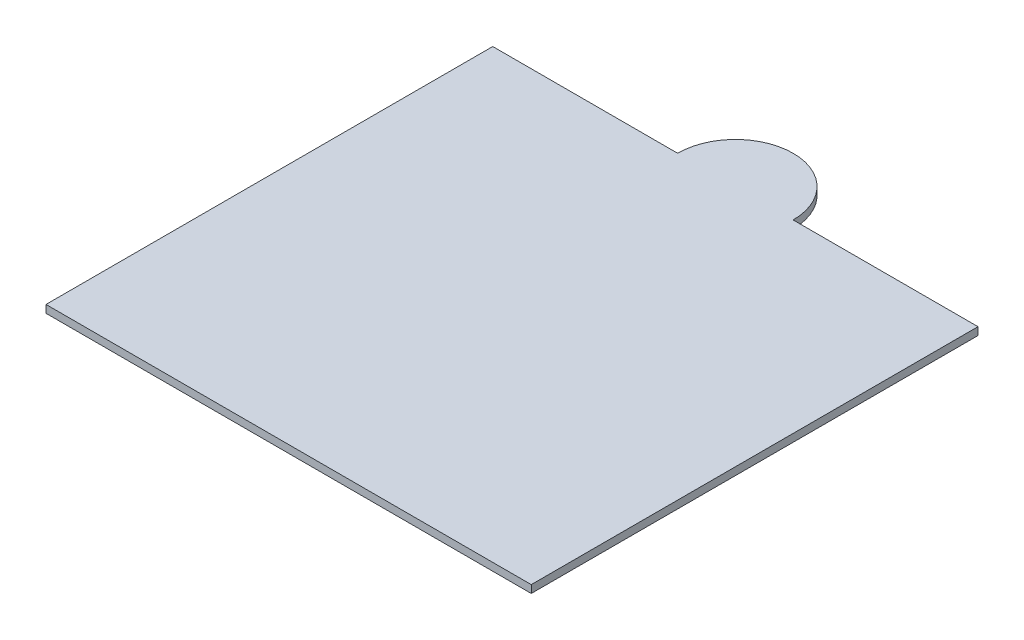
from build123d import *

# Parameters (mm, degrees)
BOSS_EXTRUDE1_DEPTH = 1


with BuildPart() as part:
    # Sketch1 → Boss-Extrude1 (new body)
    with BuildSketch(Plane(origin=(0, 0, 0), x_dir=(1, 0, 0), z_dir=(0, 1, 0))):
        with BuildLine():
            Line((-31.5, -29), (31.5, -29))
            Line((31.5, -29), (31.5, 29))
            Line((31.5, 29), (7.5, 29))
            ThreePointArc((7.5, 29), (0, 36.5), (-7.5, 29))
            Line((-7.5, 29), (-31.5, 29))
            Line((-31.5, 29), (-31.5, -29))
        make_face()
    extrude(amount=BOSS_EXTRUDE1_DEPTH)


solid = part.part
